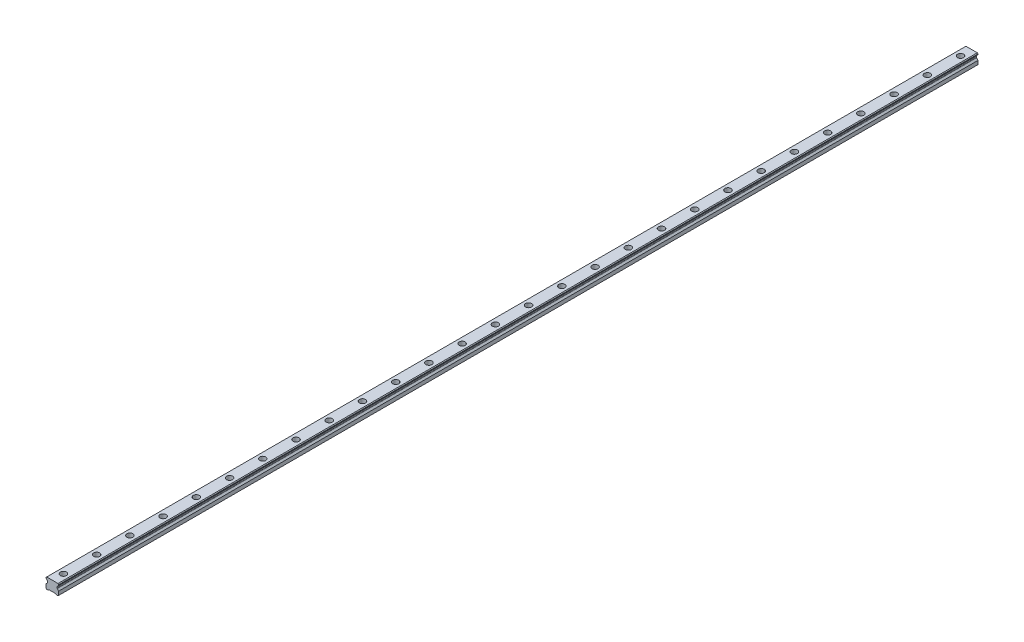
from build123d import *

# Parameters (mm, degrees)
SKETCH1_W           = 23
SKETCH1_H           = 19.2
BOSS_EXTRUDE1_DEPTH = 830
CUT_EXTRUDE1_DEPTH  = 1661.150863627
CHAMFER1_SIZE       = 1.25
FILLET1_R           = 1.25
CUT_EXTRUDE2_DEPTH  = 1661.150863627
SKETCH4_R           = 5.5
SKETCH4_R_2         = 3.5
CUT_EXTRUDE3_DEPTH  = 9
SKETCH4_2_R         = 3.5
CUT_EXTRUDE4_DEPTH  = 831.301686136
LPATTERN1_COUNT     = 28
LPATTERN1_PITCH     = 60


with BuildPart() as part:
    # Sketch1 → Boss-Extrude1 (new, symmetric)
    with BuildSketch(Plane.XY):
        with Locations((0, 9.6)):
            Rectangle(SKETCH1_W, SKETCH1_H)
    extrude(amount=BOSS_EXTRUDE1_DEPTH, both=True)

    # Sketch2 → Cut-Extrude1 (cut, through all)
    with BuildSketch(Plane.XY.offset(830)):
        Polygon((-11.5, 16.7), (-11.5, 7.95), (-8.583333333, 10.866666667), (-8.583333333, 13.783333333), align=None)
        Polygon((8.583333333, 13.783333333), (11.5, 16.7), (11.5, 7.95), (8.583333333, 10.866666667), align=None)
    extrude(amount=-CUT_EXTRUDE1_DEPTH, mode=Mode.SUBTRACT)

    # Chamfer1
    chamfer1_edges = [part.edges().sort_by_distance(p)[0] for p in [
        (-11.5, 19.2, 0),
        (11.5, 19.2, 0),
        (11.5, 0, 0),
        (-11.5, 0, 0),
    ]]
    chamfer(chamfer1_edges, length=CHAMFER1_SIZE)

    # Fillet1
    fillet1_edges = [part.edges().sort_by_distance(p)[0] for p in [
        (-8.583333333, 13.783333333, 0),
        (-8.583333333, 10.866666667, 0),
        (8.583333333, 10.866666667, 0),
        (8.583333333, 13.783333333, 0),
    ]]
    fillet(fillet1_edges, radius=FILLET1_R)

    # Sketch3 → Cut-Extrude2 (cut, through all)
    with BuildSketch(Plane.XY.offset(830)):
        Polygon((-7, 0), (-5.75, 1.25), (5.75, 1.25), (7, 0), align=None)
    extrude(amount=-CUT_EXTRUDE2_DEPTH, mode=Mode.SUBTRACT)

    # Sketch4 → Cut-Extrude3 (cut)
    with BuildSketch(Plane(origin=(0, 19.2, 0), x_dir=(1, 0, 0), z_dir=(0, 1, 0))):
        with Locations(Location((0, -810, 0), (0, 0, 270))):
            Circle(SKETCH4_R)
        with Locations(Location((0, -810, 0), (0, 0, 270))):
            Circle(SKETCH4_R_2, mode=Mode.SUBTRACT)
    cut_extrude3 = extrude(amount=-CUT_EXTRUDE3_DEPTH, mode=Mode.SUBTRACT)

    # Sketch4_2 → Cut-Extrude4 (cut, through all)
    with BuildSketch(Plane(origin=(0, 19.2, 0), x_dir=(1, 0, 0), z_dir=(0, 1, 0))):
        with Locations(Location((0, -810, 0), (0, 0, 270))):
            Circle(SKETCH4_2_R)
    cut_extrude4 = extrude(amount=-CUT_EXTRUDE4_DEPTH, mode=Mode.SUBTRACT)

    # LPattern1: Cut-Extrude3, Cut-Extrude4 ×28
    with Locations(*[(0, 0, -i * LPATTERN1_PITCH) for i in range(1, LPATTERN1_COUNT)]):
        add(cut_extrude3, mode=Mode.SUBTRACT)
        add(cut_extrude4, mode=Mode.SUBTRACT)


solid = part.part
